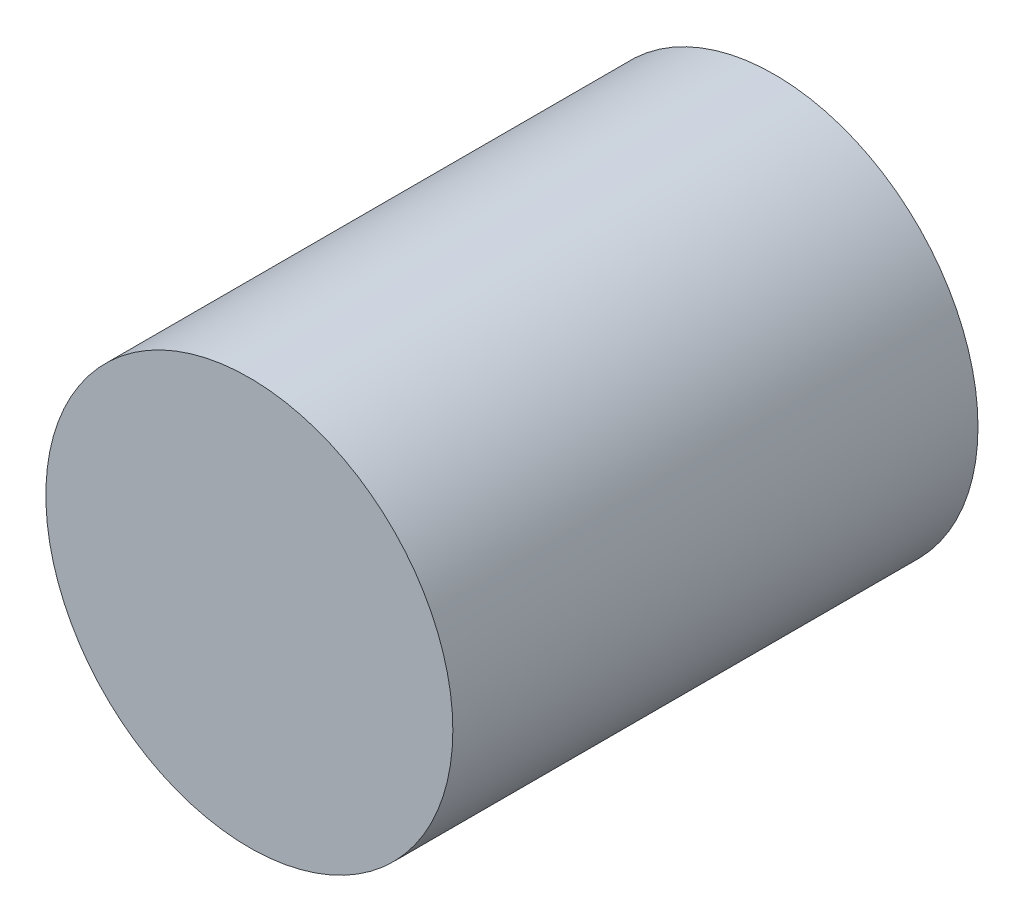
ISO-10303-21;
HEADER;
FILE_DESCRIPTION(('STEP AP214'),'2;1');
FILE_NAME('part.step','',(''),(''),'','','');
FILE_SCHEMA(('AUTOMOTIVE_DESIGN { 1 0 10303 214 1 1 1 1 }'));
ENDSEC;
DATA;
#1=APPLICATION_CONTEXT('core data for automotive mechanical design processes');
#2=APPLICATION_PROTOCOL_DEFINITION('international standard','automotive_design',2000,#1);
#3=PRODUCT_CONTEXT('',#1,'mechanical');
#4=PRODUCT('Part','Part','',(#3));
#5=PRODUCT_RELATED_PRODUCT_CATEGORY('part','',(#4));
#6=PRODUCT_DEFINITION_FORMATION('','',#4);
#7=PRODUCT_DEFINITION_CONTEXT('part definition',#1,'design');
#8=PRODUCT_DEFINITION('design','',#6,#7);
#9=PRODUCT_DEFINITION_SHAPE('','',#8);
#10=(LENGTH_UNIT() NAMED_UNIT(*) SI_UNIT(.MILLI.,.METRE.));
#11=(NAMED_UNIT(*) PLANE_ANGLE_UNIT() SI_UNIT($,.RADIAN.));
#12=(NAMED_UNIT(*) SI_UNIT($,.STERADIAN.) SOLID_ANGLE_UNIT());
#13=UNCERTAINTY_MEASURE_WITH_UNIT(LENGTH_MEASURE(1.E-05),#10,'distance_accuracy_value','');
#14=(GEOMETRIC_REPRESENTATION_CONTEXT(3) GLOBAL_UNCERTAINTY_ASSIGNED_CONTEXT((#13)) GLOBAL_UNIT_ASSIGNED_CONTEXT((#10,
#11,#12)) REPRESENTATION_CONTEXT('',''));
#15=CARTESIAN_POINT('',(0.,0.,0.));
#16=DIRECTION('',(0.,0.,1.));
#17=DIRECTION('',(1.,0.,0.));
#18=AXIS2_PLACEMENT_3D('',#15,#16,#17);
#19=CARTESIAN_POINT('',(0.,0.,10.));
#20=DIRECTION('',(0.,0.,-1.));
#21=DIRECTION('',(-1.,0.,0.));
#22=AXIS2_PLACEMENT_3D('',#19,#20,#21);
#23=CYLINDRICAL_SURFACE('',#22,7.75);
#24=CARTESIAN_POINT('',(0.,0.,10.));
#25=DIRECTION('',(0.,0.,1.));
#26=DIRECTION('',(1.,0.,0.));
#27=AXIS2_PLACEMENT_3D('',#24,#25,#26);
#28=CIRCLE('',#27,7.75);
#29=CARTESIAN_POINT('',(7.75,0.,10.));
#30=VERTEX_POINT('',#29);
#31=EDGE_CURVE('E10',#30,#30,#28,.T.);
#32=ORIENTED_EDGE('',*,*,#31,.F.);
#33=EDGE_LOOP('',(#32));
#34=FACE_BOUND('',#33,.T.);
#35=CARTESIAN_POINT('',(0.,0.,-10.));
#36=DIRECTION('',(0.,0.,1.));
#37=DIRECTION('',(1.,0.,0.));
#38=AXIS2_PLACEMENT_3D('',#35,#36,#37);
#39=CIRCLE('',#38,7.75);
#40=CARTESIAN_POINT('',(7.75,0.,-10.));
#41=VERTEX_POINT('',#40);
#42=EDGE_CURVE('E39',#41,#41,#39,.T.);
#43=ORIENTED_EDGE('',*,*,#42,.T.);
#44=EDGE_LOOP('',(#43));
#45=FACE_BOUND('',#44,.T.);
#46=ADVANCED_FACE('F33',(#34,#45),#23,.T.);
#47=CARTESIAN_POINT('',(0.,0.,10.));
#48=DIRECTION('',(0.,0.,1.));
#49=DIRECTION('',(1.,0.,0.));
#50=AXIS2_PLACEMENT_3D('',#47,#48,#49);
#51=PLANE('',#50);
#52=ORIENTED_EDGE('',*,*,#31,.T.);
#53=EDGE_LOOP('',(#52));
#54=FACE_BOUND('',#53,.T.);
#55=ADVANCED_FACE('F48',(#54),#51,.T.);
#56=CARTESIAN_POINT('',(0.,0.,-10.));
#57=DIRECTION('',(0.,0.,1.));
#58=DIRECTION('',(1.,0.,0.));
#59=AXIS2_PLACEMENT_3D('',#56,#57,#58);
#60=PLANE('',#59);
#61=ORIENTED_EDGE('',*,*,#42,.F.);
#62=EDGE_LOOP('',(#61));
#63=FACE_BOUND('',#62,.T.);
#64=ADVANCED_FACE('F46',(#63),#60,.F.);
#65=CLOSED_SHELL('',(#46,#55,#64));
#66=MANIFOLD_SOLID_BREP('B2',#65);
#67=ADVANCED_BREP_SHAPE_REPRESENTATION('',(#18,#66),#14);
#68=SHAPE_DEFINITION_REPRESENTATION(#9,#67);
ENDSEC;
END-ISO-10303-21;
